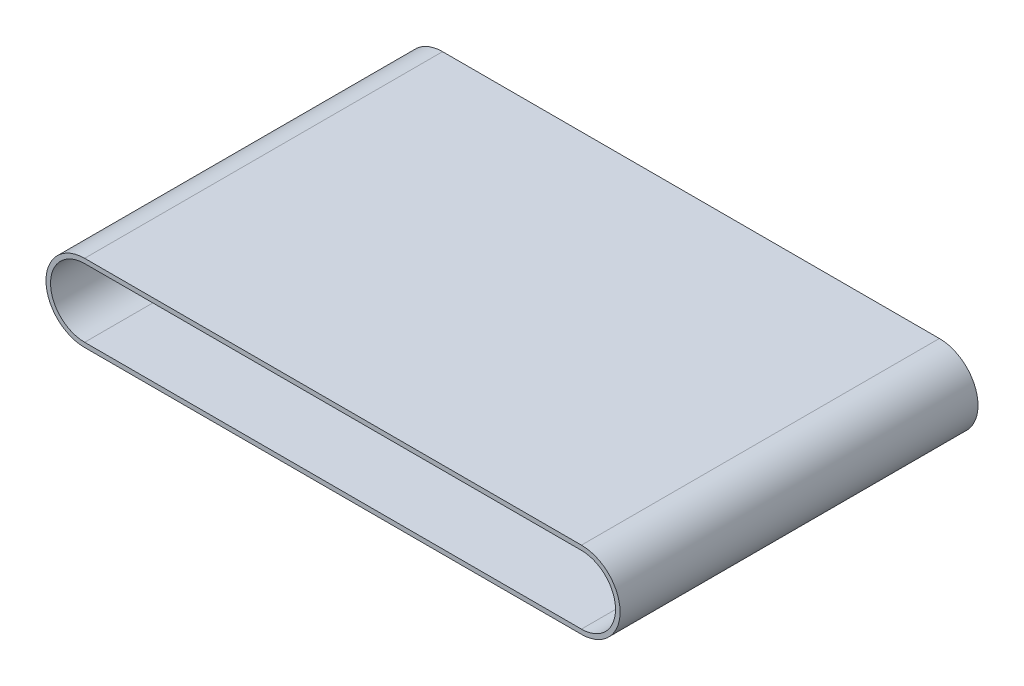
from build123d import *

# Parameters (mm, degrees)
BOSS_EXTRUDE1_DEPTH = 200


with BuildPart() as part:
    # Sketch3 → Boss-Extrude1 (new body)
    with BuildSketch(Plane(origin=(0, 0, 1284.999999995), x_dir=(-1, 0, 0), z_dir=(0, 0, -1))):
        with BuildLine():
            Line((277.591438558, 21.59), (0, 21.59))
            ThreePointArc((0, 21.59), (-21.59, 0), (0, -21.59))
            Line((0, -21.59), (277.591438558, -21.59))
            ThreePointArc((277.591438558, -21.59), (299.181438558, 0), (277.591438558, 21.59))
        make_face()
        with BuildLine():
            Line((0, -19.05), (277.591438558, -19.05))
            ThreePointArc((277.591438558, -19.05), (296.641438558, 0), (277.591438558, 19.05))
            Line((277.591438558, 19.05), (0, 19.05))
            ThreePointArc((0, 19.05), (-19.05, 0), (0, -19.05))
        make_face(mode=Mode.SUBTRACT)
    extrude(amount=BOSS_EXTRUDE1_DEPTH)


solid = part.part
